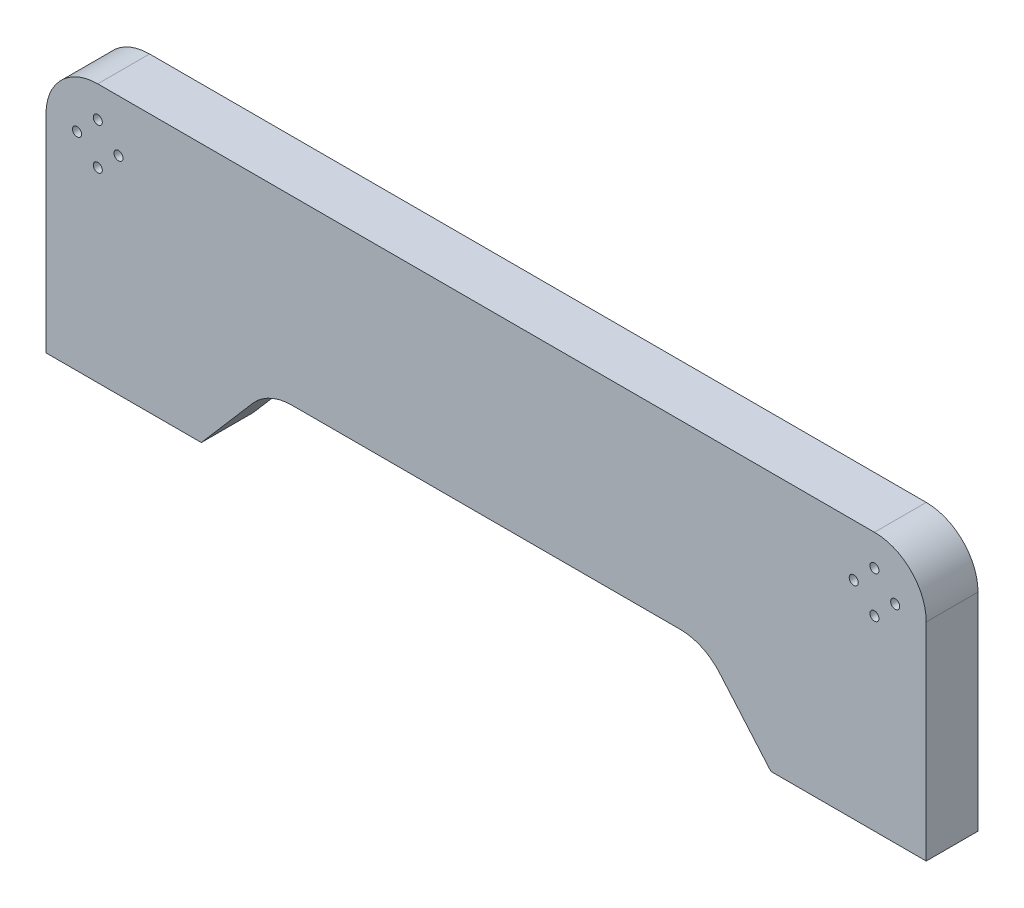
from build123d import *

# Parameters (mm, degrees)
CROQUIS1_R              = 1.75
SALIENTE_EXTRUIR1_DEPTH = 20


with BuildPart() as part:
    # Croquis1 → Saliente-Extruir1 (new body)
    with BuildSketch(Plane.XY):
        with BuildLine():
            Line((0, 0), (60, 0))
            Line((60, 0), (79.84319809, 23.048806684))
            ThreePointArc((79.84319809, 23.048806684), (86.662618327, 28.179330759), (95, 30))
            Line((95, 30), (245, 30))
            ThreePointArc((245, 30), (253.337381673, 28.179330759), (260.15680191, 23.048806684))
            Line((260.15680191, 23.048806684), (280, 0))
            Line((280, 0), (340, 0))
            Line((340, 0), (340, 80))
            ThreePointArc((340, 80), (334.142135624, 94.142135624), (320, 100))
            Line((320, 100), (20, 100))
            ThreePointArc((20, 100), (5.857864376, 94.142135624), (0, 80))
            Line((0, 80), (0, 0))
        make_face()
        with Locations((12, 80)):
            Circle(CROQUIS1_R, mode=Mode.SUBTRACT)
        with Locations((20, 88)):
            Circle(CROQUIS1_R, mode=Mode.SUBTRACT)
        with Locations((28, 80)):
            Circle(CROQUIS1_R, mode=Mode.SUBTRACT)
        with Locations((20, 72)):
            Circle(CROQUIS1_R, mode=Mode.SUBTRACT)
        with Locations(Location((320, 88, 0), (0, 0, 180))):
            Circle(CROQUIS1_R, mode=Mode.SUBTRACT)
        with Locations(Location((328, 80, 0), (0, 0, 180))):
            Circle(CROQUIS1_R, mode=Mode.SUBTRACT)
        with Locations(Location((320, 72, 0), (0, 0, 180))):
            Circle(CROQUIS1_R, mode=Mode.SUBTRACT)
        with Locations(Location((312, 80, 0), (0, 0, 180))):
            Circle(CROQUIS1_R, mode=Mode.SUBTRACT)
    extrude(amount=SALIENTE_EXTRUIR1_DEPTH)


solid = part.part
